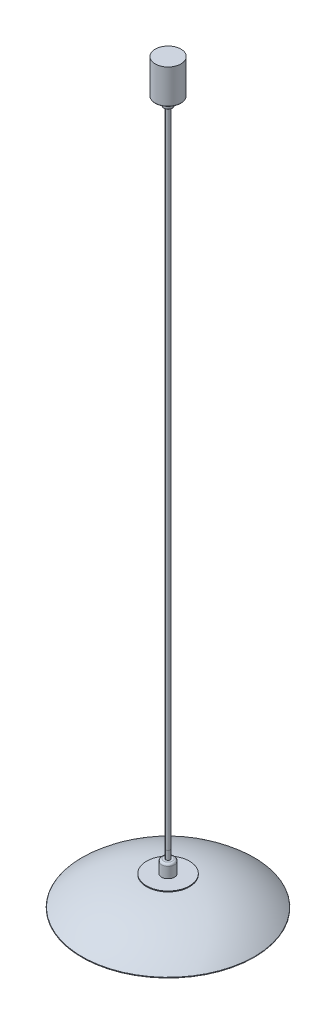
ISO-10303-21;
HEADER;
FILE_DESCRIPTION(('STEP AP214'),'2;1');
FILE_NAME('part.step','',(''),(''),'','','');
FILE_SCHEMA(('AUTOMOTIVE_DESIGN { 1 0 10303 214 1 1 1 1 }'));
ENDSEC;
DATA;
#1=APPLICATION_CONTEXT('core data for automotive mechanical design processes');
#2=APPLICATION_PROTOCOL_DEFINITION('international standard','automotive_design',2000,#1);
#3=PRODUCT_CONTEXT('',#1,'mechanical');
#4=PRODUCT('Part','Part','',(#3));
#5=PRODUCT_RELATED_PRODUCT_CATEGORY('part','',(#4));
#6=PRODUCT_DEFINITION_FORMATION('','',#4);
#7=PRODUCT_DEFINITION_CONTEXT('part definition',#1,'design');
#8=PRODUCT_DEFINITION('design','',#6,#7);
#9=PRODUCT_DEFINITION_SHAPE('','',#8);
#10=(LENGTH_UNIT() NAMED_UNIT(*) SI_UNIT(.MILLI.,.METRE.));
#11=(NAMED_UNIT(*) PLANE_ANGLE_UNIT() SI_UNIT($,.RADIAN.));
#12=(NAMED_UNIT(*) SI_UNIT($,.STERADIAN.) SOLID_ANGLE_UNIT());
#13=UNCERTAINTY_MEASURE_WITH_UNIT(LENGTH_MEASURE(1.E-05),#10,'distance_accuracy_value','');
#14=(GEOMETRIC_REPRESENTATION_CONTEXT(3) GLOBAL_UNCERTAINTY_ASSIGNED_CONTEXT((#13)) GLOBAL_UNIT_ASSIGNED_CONTEXT((#10,
#11,#12)) REPRESENTATION_CONTEXT('',''));
#15=CARTESIAN_POINT('',(0.,0.,0.));
#16=DIRECTION('',(0.,0.,1.));
#17=DIRECTION('',(1.,0.,0.));
#18=AXIS2_PLACEMENT_3D('',#15,#16,#17);
#19=CARTESIAN_POINT('',(0.,1682.,0.));
#20=DIRECTION('',(0.,-1.,0.));
#21=DIRECTION('',(0.,0.,-1.));
#22=AXIS2_PLACEMENT_3D('',#19,#20,#21);
#23=CYLINDRICAL_SURFACE('',#22,30.);
#24=CARTESIAN_POINT('',(0.,1603.,0.));
#25=DIRECTION('',(0.,1.,0.));
#26=DIRECTION('',(0.,0.,1.));
#27=AXIS2_PLACEMENT_3D('',#24,#25,#26);
#28=CIRCLE('',#27,30.);
#29=CARTESIAN_POINT('',(0.,1603.,30.));
#30=VERTEX_POINT('',#29);
#31=EDGE_CURVE('E55',#30,#30,#28,.T.);
#32=ORIENTED_EDGE('',*,*,#31,.T.);
#33=EDGE_LOOP('',(#32));
#34=FACE_BOUND('',#33,.T.);
#35=CARTESIAN_POINT('',(0.,1682.,0.));
#36=DIRECTION('',(0.,1.,0.));
#37=DIRECTION('',(0.,0.,1.));
#38=AXIS2_PLACEMENT_3D('',#35,#36,#37);
#39=CIRCLE('',#38,30.);
#40=CARTESIAN_POINT('',(0.,1682.,30.));
#41=VERTEX_POINT('',#40);
#42=EDGE_CURVE('E59',#41,#41,#39,.T.);
#43=ORIENTED_EDGE('',*,*,#42,.F.);
#44=EDGE_LOOP('',(#43));
#45=FACE_BOUND('',#44,.T.);
#46=ADVANCED_FACE('F48',(#34,#45),#23,.T.);
#47=CARTESIAN_POINT('',(0.,1682.,0.));
#48=DIRECTION('',(0.,1.,0.));
#49=DIRECTION('',(0.,0.,1.));
#50=AXIS2_PLACEMENT_3D('',#47,#48,#49);
#51=PLANE('',#50);
#52=ORIENTED_EDGE('',*,*,#42,.T.);
#53=EDGE_LOOP('',(#52));
#54=FACE_BOUND('',#53,.T.);
#55=ADVANCED_FACE('F66',(#54),#51,.T.);
#56=CARTESIAN_POINT('',(0.,1602.,0.));
#57=DIRECTION('',(0.,1.,0.));
#58=DIRECTION('',(0.,0.,1.));
#59=AXIS2_PLACEMENT_3D('',#56,#57,#58);
#60=PLANE('',#59);
#61=CARTESIAN_POINT('',(0.,1602.,0.));
#62=DIRECTION('',(0.,1.,0.));
#63=DIRECTION('',(0.,0.,1.));
#64=AXIS2_PLACEMENT_3D('',#61,#62,#63);
#65=CIRCLE('',#64,29.);
#66=CARTESIAN_POINT('',(0.,1602.,29.));
#67=VERTEX_POINT('',#66);
#68=EDGE_CURVE('E12',#67,#67,#65,.F.);
#69=ORIENTED_EDGE('',*,*,#68,.T.);
#70=EDGE_LOOP('',(#69));
#71=FACE_BOUND('',#70,.T.);
#72=ADVANCED_FACE('F72',(#71),#60,.F.);
#73=CARTESIAN_POINT('',(0.,1603.,0.));
#74=DIRECTION('',(0.,1.,0.));
#75=DIRECTION('',(0.,0.,1.));
#76=AXIS2_PLACEMENT_3D('',#73,#74,#75);
#77=TOROIDAL_SURFACE('',#76,29.,1.);
#78=ORIENTED_EDGE('',*,*,#68,.F.);
#79=EDGE_LOOP('',(#78));
#80=FACE_BOUND('',#79,.T.);
#81=ORIENTED_EDGE('',*,*,#31,.F.);
#82=EDGE_LOOP('',(#81));
#83=FACE_BOUND('',#82,.T.);
#84=ADVANCED_FACE('F50',(#80,#83),#77,.T.);
#85=CLOSED_SHELL('',(#46,#55,#72,#84));
#86=MANIFOLD_SOLID_BREP('B2',#85);
#87=CARTESIAN_POINT('',(0.,1582.,0.));
#88=DIRECTION('',(0.,-1.,0.));
#89=DIRECTION('',(0.,0.,-1.));
#90=AXIS2_PLACEMENT_3D('',#87,#88,#89);
#91=CYLINDRICAL_SURFACE('',#90,5.);
#92=CARTESIAN_POINT('',(0.,1582.,0.));
#93=DIRECTION('',(0.,1.,0.));
#94=DIRECTION('',(0.,0.,1.));
#95=AXIS2_PLACEMENT_3D('',#92,#93,#94);
#96=CIRCLE('',#95,5.);
#97=CARTESIAN_POINT('',(0.,1582.,5.));
#98=VERTEX_POINT('',#97);
#99=EDGE_CURVE('E123',#98,#98,#96,.T.);
#100=ORIENTED_EDGE('',*,*,#99,.F.);
#101=EDGE_LOOP('',(#100));
#102=FACE_BOUND('',#101,.T.);
#103=CARTESIAN_POINT('',(0.,82.,0.));
#104=DIRECTION('',(0.,1.,0.));
#105=DIRECTION('',(0.,0.,1.));
#106=AXIS2_PLACEMENT_3D('',#103,#104,#105);
#107=CIRCLE('',#106,5.);
#108=CARTESIAN_POINT('',(0.,82.,5.));
#109=VERTEX_POINT('',#108);
#110=EDGE_CURVE('E127',#109,#109,#107,.T.);
#111=ORIENTED_EDGE('',*,*,#110,.T.);
#112=EDGE_LOOP('',(#111));
#113=FACE_BOUND('',#112,.T.);
#114=ADVANCED_FACE('F112',(#102,#113),#91,.T.);
#115=CARTESIAN_POINT('',(0.,82.,0.));
#116=DIRECTION('',(0.,1.,0.));
#117=DIRECTION('',(0.,0.,1.));
#118=AXIS2_PLACEMENT_3D('',#115,#116,#117);
#119=PLANE('',#118);
#120=ORIENTED_EDGE('',*,*,#110,.F.);
#121=EDGE_LOOP('',(#120));
#122=FACE_BOUND('',#121,.T.);
#123=ADVANCED_FACE('F140',(#122),#119,.F.);
#124=CARTESIAN_POINT('',(0.,1602.,0.));
#125=DIRECTION('',(0.,-1.,0.));
#126=DIRECTION('',(0.,0.,-1.));
#127=AXIS2_PLACEMENT_3D('',#124,#125,#126);
#128=CYLINDRICAL_SURFACE('',#127,10.);
#129=CARTESIAN_POINT('',(0.,1583.,0.));
#130=DIRECTION('',(0.,1.,0.));
#131=DIRECTION('',(0.,0.,1.));
#132=AXIS2_PLACEMENT_3D('',#129,#130,#131);
#133=CIRCLE('',#132,10.);
#134=CARTESIAN_POINT('',(0.,1583.,10.));
#135=VERTEX_POINT('',#134);
#136=EDGE_CURVE('E119',#135,#135,#133,.T.);
#137=ORIENTED_EDGE('',*,*,#136,.T.);
#138=EDGE_LOOP('',(#137));
#139=FACE_BOUND('',#138,.T.);
#140=CARTESIAN_POINT('',(0.,1602.,0.));
#141=DIRECTION('',(0.,1.,0.));
#142=DIRECTION('',(0.,0.,1.));
#143=AXIS2_PLACEMENT_3D('',#140,#141,#142);
#144=CIRCLE('',#143,10.);
#145=CARTESIAN_POINT('',(0.,1602.,10.));
#146=VERTEX_POINT('',#145);
#147=EDGE_CURVE('E131',#146,#146,#144,.T.);
#148=ORIENTED_EDGE('',*,*,#147,.F.);
#149=EDGE_LOOP('',(#148));
#150=FACE_BOUND('',#149,.T.);
#151=ADVANCED_FACE('F138',(#139,#150),#128,.T.);
#152=CARTESIAN_POINT('',(0.,1602.,0.));
#153=DIRECTION('',(0.,1.,0.));
#154=DIRECTION('',(0.,0.,1.));
#155=AXIS2_PLACEMENT_3D('',#152,#153,#154);
#156=PLANE('',#155);
#157=ORIENTED_EDGE('',*,*,#147,.T.);
#158=EDGE_LOOP('',(#157));
#159=FACE_BOUND('',#158,.T.);
#160=ADVANCED_FACE('F136',(#159),#156,.T.);
#161=CARTESIAN_POINT('',(0.,1582.,0.));
#162=DIRECTION('',(0.,1.,0.));
#163=DIRECTION('',(0.,0.,1.));
#164=AXIS2_PLACEMENT_3D('',#161,#162,#163);
#165=PLANE('',#164);
#166=CARTESIAN_POINT('',(0.,1582.,0.));
#167=DIRECTION('',(0.,1.,0.));
#168=DIRECTION('',(0.,0.,1.));
#169=AXIS2_PLACEMENT_3D('',#166,#167,#168);
#170=CIRCLE('',#169,9.);
#171=CARTESIAN_POINT('',(0.,1582.,9.));
#172=VERTEX_POINT('',#171);
#173=EDGE_CURVE('E47',#172,#172,#170,.F.);
#174=ORIENTED_EDGE('',*,*,#173,.T.);
#175=EDGE_LOOP('',(#174));
#176=FACE_BOUND('',#175,.T.);
#177=ORIENTED_EDGE('',*,*,#99,.T.);
#178=EDGE_LOOP('',(#177));
#179=FACE_BOUND('',#178,.T.);
#180=ADVANCED_FACE('F146',(#176,#179),#165,.F.);
#181=CARTESIAN_POINT('',(0.,1583.,0.));
#182=DIRECTION('',(0.,1.,0.));
#183=DIRECTION('',(0.,0.,1.));
#184=AXIS2_PLACEMENT_3D('',#181,#182,#183);
#185=TOROIDAL_SURFACE('',#184,9.,1.);
#186=ORIENTED_EDGE('',*,*,#173,.F.);
#187=EDGE_LOOP('',(#186));
#188=FACE_BOUND('',#187,.T.);
#189=ORIENTED_EDGE('',*,*,#136,.F.);
#190=EDGE_LOOP('',(#189));
#191=FACE_BOUND('',#190,.T.);
#192=ADVANCED_FACE('F114',(#188,#191),#185,.T.);
#193=CLOSED_SHELL('',(#114,#123,#151,#160,#180,#192));
#194=MANIFOLD_SOLID_BREP('B7',#193);
#195=CARTESIAN_POINT('',(0.,82.,0.));
#196=DIRECTION('',(0.,-1.,0.));
#197=DIRECTION('',(0.,0.,-1.));
#198=AXIS2_PLACEMENT_3D('',#195,#196,#197);
#199=CYLINDRICAL_SURFACE('',#198,5.);
#200=CARTESIAN_POINT('',(0.,82.,0.));
#201=DIRECTION('',(0.,1.,0.));
#202=DIRECTION('',(0.,0.,1.));
#203=AXIS2_PLACEMENT_3D('',#200,#201,#202);
#204=CIRCLE('',#203,5.);
#205=CARTESIAN_POINT('',(0.,82.,5.));
#206=VERTEX_POINT('',#205);
#207=EDGE_CURVE('E111',#206,#206,#204,.T.);
#208=ORIENTED_EDGE('',*,*,#207,.F.);
#209=EDGE_LOOP('',(#208));
#210=FACE_BOUND('',#209,.T.);
#211=CARTESIAN_POINT('',(0.,62.,0.));
#212=DIRECTION('',(0.,1.,0.));
#213=DIRECTION('',(0.,0.,1.));
#214=AXIS2_PLACEMENT_3D('',#211,#212,#213);
#215=CIRCLE('',#214,5.);
#216=CARTESIAN_POINT('',(0.,62.,5.));
#217=VERTEX_POINT('',#216);
#218=EDGE_CURVE('E211',#217,#217,#215,.T.);
#219=ORIENTED_EDGE('',*,*,#218,.T.);
#220=EDGE_LOOP('',(#219));
#221=FACE_BOUND('',#220,.T.);
#222=ADVANCED_FACE('F208',(#210,#221),#199,.T.);
#223=CARTESIAN_POINT('',(0.,82.,0.));
#224=DIRECTION('',(0.,1.,0.));
#225=DIRECTION('',(0.,0.,1.));
#226=AXIS2_PLACEMENT_3D('',#223,#224,#225);
#227=PLANE('',#226);
#228=ORIENTED_EDGE('',*,*,#207,.T.);
#229=EDGE_LOOP('',(#228));
#230=FACE_BOUND('',#229,.T.);
#231=ADVANCED_FACE('F223',(#230),#227,.T.);
#232=CARTESIAN_POINT('',(0.,62.,0.));
#233=DIRECTION('',(0.,1.,0.));
#234=DIRECTION('',(0.,0.,1.));
#235=AXIS2_PLACEMENT_3D('',#232,#233,#234);
#236=PLANE('',#235);
#237=ORIENTED_EDGE('',*,*,#218,.F.);
#238=EDGE_LOOP('',(#237));
#239=FACE_BOUND('',#238,.T.);
#240=ADVANCED_FACE('F221',(#239),#236,.F.);
#241=CLOSED_SHELL('',(#222,#231,#240));
#242=MANIFOLD_SOLID_BREP('B42',#241);
#243=CARTESIAN_POINT('',(0.,32.,0.));
#244=DIRECTION('',(0.,1.,0.));
#245=DIRECTION('',(-1.,0.,0.));
#246=AXIS2_PLACEMENT_3D('',#243,#244,#245);
#247=PLANE('',#246);
#248=CARTESIAN_POINT('',(0.,32.,0.));
#249=DIRECTION('',(0.,1.,0.));
#250=DIRECTION('',(-1.,0.,0.));
#251=AXIS2_PLACEMENT_3D('',#248,#249,#250);
#252=CIRCLE('',#251,15.);
#253=CARTESIAN_POINT('',(-15.,32.,0.));
#254=VERTEX_POINT('',#253);
#255=EDGE_CURVE('E270',#254,#254,#252,.T.);
#256=ORIENTED_EDGE('',*,*,#255,.F.);
#257=EDGE_LOOP('',(#256));
#258=FACE_BOUND('',#257,.T.);
#259=ADVANCED_FACE('F259',(#258),#247,.F.);
#260=CARTESIAN_POINT('',(0.,62.,0.));
#261=DIRECTION('',(0.,1.,0.));
#262=DIRECTION('',(-1.,0.,0.));
#263=AXIS2_PLACEMENT_3D('',#260,#261,#262);
#264=PLANE('',#263);
#265=CARTESIAN_POINT('',(0.,62.,0.));
#266=DIRECTION('',(0.,1.,0.));
#267=DIRECTION('',(-1.,0.,0.));
#268=AXIS2_PLACEMENT_3D('',#265,#266,#267);
#269=CIRCLE('',#268,10.);
#270=CARTESIAN_POINT('',(-10.,62.,0.));
#271=VERTEX_POINT('',#270);
#272=EDGE_CURVE('E266',#271,#271,#269,.T.);
#273=ORIENTED_EDGE('',*,*,#272,.T.);
#274=EDGE_LOOP('',(#273));
#275=FACE_BOUND('',#274,.T.);
#276=ADVANCED_FACE('F276',(#275),#264,.T.);
#277=CARTESIAN_POINT('',(0.,32.,0.));
#278=DIRECTION('',(0.,1.,0.));
#279=DIRECTION('',(-1.,0.,0.));
#280=AXIS2_PLACEMENT_3D('',#277,#278,#279);
#281=CYLINDRICAL_SURFACE('',#280,15.);
#282=CARTESIAN_POINT('',(0.,57.,0.));
#283=DIRECTION('',(0.,1.,0.));
#284=DIRECTION('',(-1.,0.,0.));
#285=AXIS2_PLACEMENT_3D('',#282,#283,#284);
#286=CIRCLE('',#285,15.);
#287=CARTESIAN_POINT('',(-15.,57.,0.));
#288=VERTEX_POINT('',#287);
#289=EDGE_CURVE('E206',#288,#288,#286,.F.);
#290=ORIENTED_EDGE('',*,*,#289,.T.);
#291=EDGE_LOOP('',(#290));
#292=FACE_BOUND('',#291,.T.);
#293=ORIENTED_EDGE('',*,*,#255,.T.);
#294=EDGE_LOOP('',(#293));
#295=FACE_BOUND('',#294,.T.);
#296=ADVANCED_FACE('F279',(#292,#295),#281,.T.);
#297=CARTESIAN_POINT('',(0.,57.,0.));
#298=DIRECTION('',(0.,1.,0.));
#299=DIRECTION('',(-1.,0.,0.));
#300=AXIS2_PLACEMENT_3D('',#297,#298,#299);
#301=TOROIDAL_SURFACE('',#300,10.,5.);
#302=ORIENTED_EDGE('',*,*,#289,.F.);
#303=EDGE_LOOP('',(#302));
#304=FACE_BOUND('',#303,.T.);
#305=ORIENTED_EDGE('',*,*,#272,.F.);
#306=EDGE_LOOP('',(#305));
#307=FACE_BOUND('',#306,.T.);
#308=ADVANCED_FACE('F261',(#304,#307),#301,.T.);
#309=CLOSED_SHELL('',(#259,#276,#296,#308));
#310=MANIFOLD_SOLID_BREP('B106',#309);
#311=CARTESIAN_POINT('',(-24.8159644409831,-236.835494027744,0.));
#312=DIRECTION('',(0.,0.,-1.));
#313=DIRECTION('',(-1.,0.,0.));
#314=AXIS2_PLACEMENT_3D('',#311,#312,#313);
#315=CIRCLE('',#314,265.);
#316=TRIMMED_CURVE('',#315,(PARAMETER_VALUE(-1.66457888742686)),
(PARAMETER_VALUE(1.66457888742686)),.T.,.PARAMETER.);
#317=CARTESIAN_POINT('',(0.,-236.835494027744,0.));
#318=DIRECTION('',(0.,1.,0.));
#319=AXIS1_PLACEMENT('',#317,#318);
#320=SURFACE_OF_REVOLUTION('',#316,#319);
#321=CARTESIAN_POINT('',(0.,-37.3428184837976,0.));
#322=DIRECTION('',(0.,-1.,0.));
#323=DIRECTION('',(1.,0.,0.));
#324=AXIS2_PLACEMENT_3D('',#321,#322,#323);
#325=CIRCLE('',#324,199.251260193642);
#326=CARTESIAN_POINT('',(199.251260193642,-37.3428184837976,0.));
#327=VERTEX_POINT('',#326);
#328=EDGE_CURVE('E257',#327,#327,#325,.T.);
#329=ORIENTED_EDGE('',*,*,#328,.T.);
#330=EDGE_LOOP('',(#329));
#331=FACE_BOUND('',#330,.T.);
#332=CARTESIAN_POINT('',(0.,27.,0.));
#333=VERTEX_POINT('',#332);
#334=VERTEX_LOOP('',#333);
#335=FACE_BOUND('',#334,.T.);
#336=ADVANCED_FACE('F323',(#331,#335),#320,.F.);
#337=CARTESIAN_POINT('',(-24.8159644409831,-236.835494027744,0.));
#338=DIRECTION('',(0.,0.,-1.));
#339=DIRECTION('',(-1.,0.,0.));
#340=AXIS2_PLACEMENT_3D('',#337,#338,#339);
#341=CIRCLE('',#340,267.);
#342=TRIMMED_CURVE('',#341,(PARAMETER_VALUE(-1.66387435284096)),
(PARAMETER_VALUE(1.66387435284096)),.T.,.PARAMETER.);
#343=CARTESIAN_POINT('',(0.,-236.835494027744,0.));
#344=DIRECTION('',(0.,1.,0.));
#345=AXIS1_PLACEMENT('',#343,#344);
#346=SURFACE_OF_REVOLUTION('',#342,#345);
#347=CARTESIAN_POINT('',(0.,-35.8372133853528,0.));
#348=DIRECTION('',(0.,-1.,0.));
#349=DIRECTION('',(1.,0.,0.));
#350=AXIS2_PLACEMENT_3D('',#347,#348,#349);
#351=CIRCLE('',#350,200.567752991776);
#352=CARTESIAN_POINT('',(200.567752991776,-35.8372133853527,0.));
#353=VERTEX_POINT('',#352);
#354=EDGE_CURVE('E332',#353,#353,#351,.F.);
#355=ORIENTED_EDGE('',*,*,#354,.T.);
#356=EDGE_LOOP('',(#355));
#357=FACE_BOUND('',#356,.T.);
#358=CARTESIAN_POINT('',(0.,29.0087609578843,0.));
#359=VERTEX_POINT('',#358);
#360=VERTEX_LOOP('',#359);
#361=FACE_BOUND('',#360,.T.);
#362=ADVANCED_FACE('F339',(#357,#361),#346,.T.);
#363=CARTESIAN_POINT('',(0.,-36.5900159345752,0.));
#364=DIRECTION('',(0.,-1.,0.));
#365=DIRECTION('',(1.,0.,0.));
#366=AXIS2_PLACEMENT_3D('',#363,#364,#365);
#367=TOROIDAL_SURFACE('',#366,199.909506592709,1.);
#368=ORIENTED_EDGE('',*,*,#328,.F.);
#369=EDGE_LOOP('',(#368));
#370=FACE_BOUND('',#369,.T.);
#371=CARTESIAN_POINT('',(0.,-37.2510877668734,0.));
#372=DIRECTION('',(0.,-1.,0.));
#373=DIRECTION('',(1.,0.,0.));
#374=AXIS2_PLACEMENT_3D('',#371,#372,#373);
#375=CIRCLE('',#374,200.659829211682);
#376=CARTESIAN_POINT('',(200.659829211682,-37.2510877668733,0.));
#377=VERTEX_POINT('',#376);
#378=EDGE_CURVE('E327',#377,#377,#375,.F.);
#379=ORIENTED_EDGE('',*,*,#378,.F.);
#380=EDGE_LOOP('',(#379));
#381=FACE_BOUND('',#380,.T.);
#382=ADVANCED_FACE('F325',(#370,#381),#367,.T.);
#383=CARTESIAN_POINT('',(0.,-36.5900159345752,0.));
#384=DIRECTION('',(0.,-1.,0.));
#385=DIRECTION('',(1.,0.,0.));
#386=AXIS2_PLACEMENT_3D('',#383,#384,#385);
#387=TOROIDAL_SURFACE('',#386,199.909506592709,1.);
#388=ORIENTED_EDGE('',*,*,#378,.T.);
#389=EDGE_LOOP('',(#388));
#390=FACE_BOUND('',#389,.T.);
#391=ORIENTED_EDGE('',*,*,#354,.F.);
#392=EDGE_LOOP('',(#391));
#393=FACE_BOUND('',#392,.T.);
#394=ADVANCED_FACE('F347',(#390,#393),#387,.T.);
#395=CLOSED_SHELL('',(#336,#362,#382,#394));
#396=MANIFOLD_SOLID_BREP('B200',#395);
#397=CARTESIAN_POINT('',(0.,32.,0.));
#398=DIRECTION('',(0.,-1.,0.));
#399=DIRECTION('',(0.,0.,-1.));
#400=AXIS2_PLACEMENT_3D('',#397,#398,#399);
#401=CYLINDRICAL_SURFACE('',#400,50.);
#402=CARTESIAN_POINT('',(0.,32.,0.));
#403=DIRECTION('',(0.,1.,0.));
#404=DIRECTION('',(0.,0.,1.));
#405=AXIS2_PLACEMENT_3D('',#402,#403,#404);
#406=CIRCLE('',#405,50.);
#407=CARTESIAN_POINT('',(0.,32.,50.));
#408=VERTEX_POINT('',#407);
#409=EDGE_CURVE('E322',#408,#408,#406,.T.);
#410=ORIENTED_EDGE('',*,*,#409,.F.);
#411=EDGE_LOOP('',(#410));
#412=FACE_BOUND('',#411,.T.);
#413=CARTESIAN_POINT('',(0.,30.,0.));
#414=DIRECTION('',(0.,1.,0.));
#415=DIRECTION('',(0.,0.,1.));
#416=AXIS2_PLACEMENT_3D('',#413,#414,#415);
#417=CIRCLE('',#416,50.);
#418=CARTESIAN_POINT('',(0.,30.,50.));
#419=VERTEX_POINT('',#418);
#420=EDGE_CURVE('E396',#419,#419,#417,.T.);
#421=ORIENTED_EDGE('',*,*,#420,.T.);
#422=EDGE_LOOP('',(#421));
#423=FACE_BOUND('',#422,.T.);
#424=ADVANCED_FACE('F393',(#412,#423),#401,.T.);
#425=CARTESIAN_POINT('',(0.,32.,0.));
#426=DIRECTION('',(0.,1.,0.));
#427=DIRECTION('',(0.,0.,1.));
#428=AXIS2_PLACEMENT_3D('',#425,#426,#427);
#429=PLANE('',#428);
#430=ORIENTED_EDGE('',*,*,#409,.T.);
#431=EDGE_LOOP('',(#430));
#432=FACE_BOUND('',#431,.T.);
#433=ADVANCED_FACE('F408',(#432),#429,.T.);
#434=CARTESIAN_POINT('',(0.,30.,0.));
#435=DIRECTION('',(0.,1.,0.));
#436=DIRECTION('',(0.,0.,1.));
#437=AXIS2_PLACEMENT_3D('',#434,#435,#436);
#438=PLANE('',#437);
#439=ORIENTED_EDGE('',*,*,#420,.F.);
#440=EDGE_LOOP('',(#439));
#441=FACE_BOUND('',#440,.T.);
#442=ADVANCED_FACE('F406',(#441),#438,.F.);
#443=CLOSED_SHELL('',(#424,#433,#442));
#444=MANIFOLD_SOLID_BREP('B251',#443);
#445=CARTESIAN_POINT('',(0.,-10.,0.));
#446=DIRECTION('',(0.,1.,0.));
#447=DIRECTION('',(0.,0.,1.));
#448=AXIS2_PLACEMENT_3D('',#445,#446,#447);
#449=CYLINDRICAL_SURFACE('',#448,50.);
#450=CARTESIAN_POINT('',(0.,0.,0.));
#451=DIRECTION('',(0.,-1.,0.));
#452=DIRECTION('',(0.,0.,-1.));
#453=AXIS2_PLACEMENT_3D('',#450,#451,#452);
#454=CIRCLE('',#453,50.);
#455=CARTESIAN_POINT('',(0.,0.,-50.));
#456=VERTEX_POINT('',#455);
#457=EDGE_CURVE('E392',#456,#456,#454,.F.);
#458=ORIENTED_EDGE('',*,*,#457,.T.);
#459=EDGE_LOOP('',(#458));
#460=FACE_BOUND('',#459,.T.);
#461=CARTESIAN_POINT('',(0.,5.,0.));
#462=DIRECTION('',(0.,-1.,0.));
#463=DIRECTION('',(0.,0.,-1.));
#464=AXIS2_PLACEMENT_3D('',#461,#462,#463);
#465=CIRCLE('',#464,50.);
#466=CARTESIAN_POINT('',(0.,5.,-50.));
#467=VERTEX_POINT('',#466);
#468=EDGE_CURVE('E453',#467,#467,#465,.T.);
#469=ORIENTED_EDGE('',*,*,#468,.T.);
#470=EDGE_LOOP('',(#469));
#471=FACE_BOUND('',#470,.T.);
#472=ADVANCED_FACE('F442',(#460,#471),#449,.T.);
#473=CARTESIAN_POINT('',(0.,-10.,0.));
#474=DIRECTION('',(0.,-1.,0.));
#475=DIRECTION('',(0.,0.,-1.));
#476=AXIS2_PLACEMENT_3D('',#473,#474,#475);
#477=PLANE('',#476);
#478=CARTESIAN_POINT('',(0.,-10.,0.));
#479=DIRECTION('',(0.,-1.,0.));
#480=DIRECTION('',(0.,0.,-1.));
#481=AXIS2_PLACEMENT_3D('',#478,#479,#480);
#482=CIRCLE('',#481,40.);
#483=CARTESIAN_POINT('',(0.,-10.,-40.));
#484=VERTEX_POINT('',#483);
#485=EDGE_CURVE('E449',#484,#484,#482,.T.);
#486=ORIENTED_EDGE('',*,*,#485,.T.);
#487=EDGE_LOOP('',(#486));
#488=FACE_BOUND('',#487,.T.);
#489=ADVANCED_FACE('F463',(#488),#477,.T.);
#490=CARTESIAN_POINT('',(0.,5.,0.));
#491=DIRECTION('',(0.,-1.,0.));
#492=DIRECTION('',(0.,0.,-1.));
#493=AXIS2_PLACEMENT_3D('',#490,#491,#492);
#494=PLANE('',#493);
#495=ORIENTED_EDGE('',*,*,#468,.F.);
#496=EDGE_LOOP('',(#495));
#497=FACE_BOUND('',#496,.T.);
#498=ADVANCED_FACE('F461',(#497),#494,.F.);
#499=CARTESIAN_POINT('',(0.,0.,0.));
#500=DIRECTION('',(0.,-1.,0.));
#501=DIRECTION('',(0.,0.,-1.));
#502=AXIS2_PLACEMENT_3D('',#499,#500,#501);
#503=TOROIDAL_SURFACE('',#502,40.,10.);
#504=ORIENTED_EDGE('',*,*,#457,.F.);
#505=EDGE_LOOP('',(#504));
#506=FACE_BOUND('',#505,.T.);
#507=ORIENTED_EDGE('',*,*,#485,.F.);
#508=EDGE_LOOP('',(#507));
#509=FACE_BOUND('',#508,.T.);
#510=ADVANCED_FACE('F444',(#506,#509),#503,.T.);
#511=CLOSED_SHELL('',(#472,#489,#498,#510));
#512=MANIFOLD_SOLID_BREP('B317',#511);
#513=CARTESIAN_POINT('',(0.,5.,0.));
#514=DIRECTION('',(0.,1.,0.));
#515=DIRECTION('',(0.,0.,1.));
#516=AXIS2_PLACEMENT_3D('',#513,#514,#515);
#517=CYLINDRICAL_SURFACE('',#516,50.);
#518=CARTESIAN_POINT('',(0.,5.,0.));
#519=DIRECTION('',(0.,-1.,0.));
#520=DIRECTION('',(0.,0.,-1.));
#521=AXIS2_PLACEMENT_3D('',#518,#519,#520);
#522=CIRCLE('',#521,50.);
#523=CARTESIAN_POINT('',(0.,5.,-50.));
#524=VERTEX_POINT('',#523);
#525=EDGE_CURVE('E441',#524,#524,#522,.T.);
#526=ORIENTED_EDGE('',*,*,#525,.F.);
#527=EDGE_LOOP('',(#526));
#528=FACE_BOUND('',#527,.T.);
#529=CARTESIAN_POINT('',(0.,25.,0.));
#530=DIRECTION('',(0.,-1.,0.));
#531=DIRECTION('',(0.,0.,-1.));
#532=AXIS2_PLACEMENT_3D('',#529,#530,#531);
#533=CIRCLE('',#532,50.);
#534=CARTESIAN_POINT('',(0.,25.,-50.));
#535=VERTEX_POINT('',#534);
#536=EDGE_CURVE('E508',#535,#535,#533,.T.);
#537=ORIENTED_EDGE('',*,*,#536,.T.);
#538=EDGE_LOOP('',(#537));
#539=FACE_BOUND('',#538,.T.);
#540=ADVANCED_FACE('F505',(#528,#539),#517,.T.);
#541=CARTESIAN_POINT('',(0.,5.,0.));
#542=DIRECTION('',(0.,-1.,0.));
#543=DIRECTION('',(0.,0.,-1.));
#544=AXIS2_PLACEMENT_3D('',#541,#542,#543);
#545=PLANE('',#544);
#546=ORIENTED_EDGE('',*,*,#525,.T.);
#547=EDGE_LOOP('',(#546));
#548=FACE_BOUND('',#547,.T.);
#549=ADVANCED_FACE('F520',(#548),#545,.T.);
#550=CARTESIAN_POINT('',(0.,25.,0.));
#551=DIRECTION('',(0.,-1.,0.));
#552=DIRECTION('',(0.,0.,-1.));
#553=AXIS2_PLACEMENT_3D('',#550,#551,#552);
#554=PLANE('',#553);
#555=ORIENTED_EDGE('',*,*,#536,.F.);
#556=EDGE_LOOP('',(#555));
#557=FACE_BOUND('',#556,.T.);
#558=ADVANCED_FACE('F518',(#557),#554,.F.);
#559=CLOSED_SHELL('',(#540,#549,#558));
#560=MANIFOLD_SOLID_BREP('B387',#559);
#561=CARTESIAN_POINT('',(0.,25.,0.));
#562=DIRECTION('',(0.,1.,0.));
#563=DIRECTION('',(0.,0.,1.));
#564=AXIS2_PLACEMENT_3D('',#561,#562,#563);
#565=CYLINDRICAL_SURFACE('',#564,50.);
#566=CARTESIAN_POINT('',(0.,25.,0.));
#567=DIRECTION('',(0.,-1.,0.));
#568=DIRECTION('',(0.,0.,-1.));
#569=AXIS2_PLACEMENT_3D('',#566,#567,#568);
#570=CIRCLE('',#569,50.);
#571=CARTESIAN_POINT('',(0.,25.,-50.));
#572=VERTEX_POINT('',#571);
#573=EDGE_CURVE('E504',#572,#572,#570,.T.);
#574=ORIENTED_EDGE('',*,*,#573,.F.);
#575=EDGE_LOOP('',(#574));
#576=FACE_BOUND('',#575,.T.);
#577=CARTESIAN_POINT('',(0.,27.,0.));
#578=DIRECTION('',(0.,-1.,0.));
#579=DIRECTION('',(0.,0.,-1.));
#580=AXIS2_PLACEMENT_3D('',#577,#578,#579);
#581=CIRCLE('',#580,50.);
#582=CARTESIAN_POINT('',(0.,27.,-50.));
#583=VERTEX_POINT('',#582);
#584=EDGE_CURVE('E549',#583,#583,#581,.T.);
#585=ORIENTED_EDGE('',*,*,#584,.T.);
#586=EDGE_LOOP('',(#585));
#587=FACE_BOUND('',#586,.T.);
#588=ADVANCED_FACE('F546',(#576,#587),#565,.T.);
#589=CARTESIAN_POINT('',(0.,25.,0.));
#590=DIRECTION('',(0.,-1.,0.));
#591=DIRECTION('',(0.,0.,-1.));
#592=AXIS2_PLACEMENT_3D('',#589,#590,#591);
#593=PLANE('',#592);
#594=ORIENTED_EDGE('',*,*,#573,.T.);
#595=EDGE_LOOP('',(#594));
#596=FACE_BOUND('',#595,.T.);
#597=ADVANCED_FACE('F561',(#596),#593,.T.);
#598=CARTESIAN_POINT('',(0.,27.,0.));
#599=DIRECTION('',(0.,-1.,0.));
#600=DIRECTION('',(0.,0.,-1.));
#601=AXIS2_PLACEMENT_3D('',#598,#599,#600);
#602=PLANE('',#601);
#603=ORIENTED_EDGE('',*,*,#584,.F.);
#604=EDGE_LOOP('',(#603));
#605=FACE_BOUND('',#604,.T.);
#606=ADVANCED_FACE('F559',(#605),#602,.F.);
#607=CLOSED_SHELL('',(#588,#597,#606));
#608=MANIFOLD_SOLID_BREP('B436',#607);
#609=ADVANCED_BREP_SHAPE_REPRESENTATION('',(#18,#86,#194,#242,#310,#396,#444,#512,#560,#608),#14);
#610=SHAPE_DEFINITION_REPRESENTATION(#9,#609);
ENDSEC;
END-ISO-10303-21;
